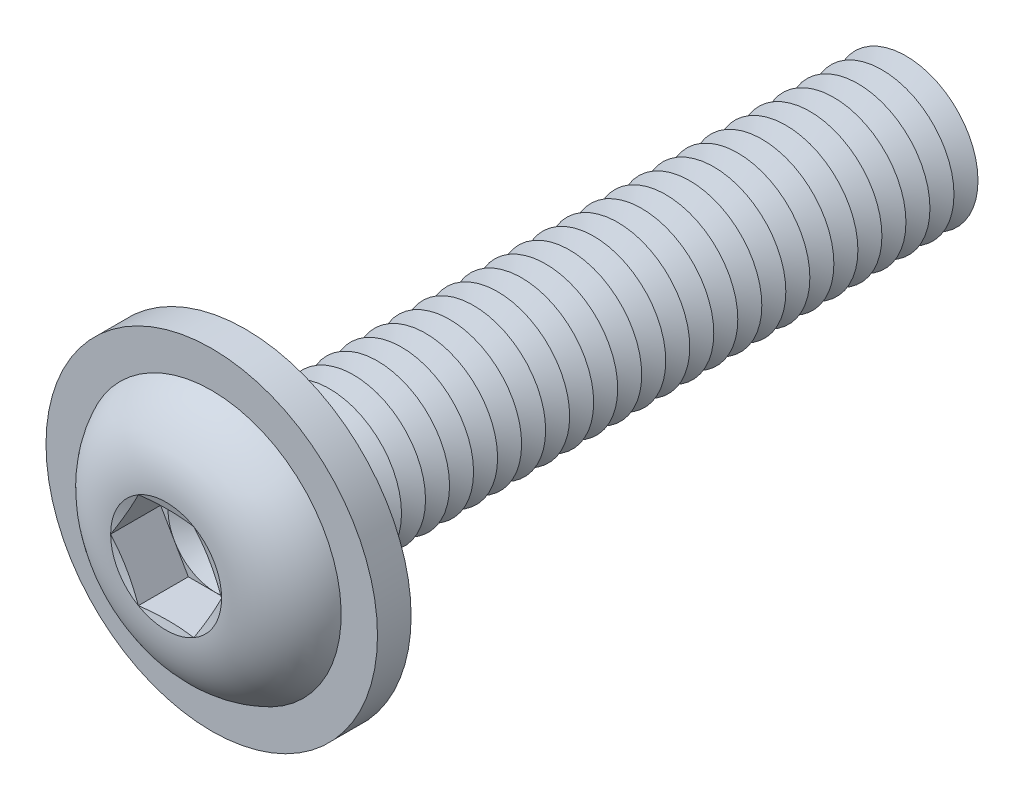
from build123d import *

# Parameters (mm, degrees)
FILLET1_R           = 0.25
LPATTERN1_COUNT     = 28
LPATTERN1_PITCH     = 0.5
CUT_EXTRUDE1_DEPTH  = 1.04
SKETCH5_R           = 3.45
SKETCH5_R_2         = 1.75
BOSS_EXTRUDE1_DEPTH = 0.7


with BuildPart() as part:
    # Sketch1 → Revolve1 (revolve)
    with BuildSketch(Plane(origin=(0, 0, 0), x_dir=(0, 0, -1), z_dir=(1, 0, 0)), mode=Mode.PRIVATE) as revolve1_sk:
        with BuildLine():
            Line((0, 1.5), (0, 2.85))
            ThreePointArc((0, 2.85), (-1.182850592, 2.35063849), (-1.65, 1.1547))
            Line((-1.65, 1.1547), (-1.495299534, 0.57735))
            Line((-1.495299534, 0.57735), (-1.65, 0.57735))
            Line((-1.65, 0.57735), (-1.65, 0))
            Line((-1.65, 0), (14, 0))
            Line((14, 0), (14, 1.5))
            Line((14, 1.5), (0, 1.5))
        make_face()
    revolve(revolve1_sk.sketch.rotate(Axis((0, 0, -14), (0, 0, 1)), 90), axis=Axis((0, 0, -14), (0, 0, 1)))

    # Fillet1
    fillet1_edges = [part.edges().sort_by_distance(p)[0] for p in [
        (1.5, 0, 0),
    ]]
    fillet(fillet1_edges, radius=FILLET1_R)

    # Sketch2 → Cut-Revolve1 (revolve, cut)
    with BuildSketch(Plane(origin=(0, 0, 0), x_dir=(0, 0, -1), z_dir=(1, 0, 0)), mode=Mode.PRIVATE) as cut_revolve1_sk:
        Polygon((13.75, 1.5), (14.25, 1.5), (14, 1.066987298), align=None)
    cut_revolve1 = revolve(cut_revolve1_sk.sketch.rotate(Axis((0, 0, -14), (0, 0, -1)), 270), axis=Axis((0, 0, -14), (0, 0, -1)), mode=Mode.SUBTRACT)

    # LPattern1: Cut-Revolve1 ×28
    with Locations(*[(0, 0, i * LPATTERN1_PITCH) for i in range(1, LPATTERN1_COUNT)]):
        add(cut_revolve1, mode=Mode.SUBTRACT)

    # Sketch3 → Cut-Extrude1 (cut)
    with BuildSketch(Plane.XY.offset(1.65)):
        Polygon((0.57735, 0.999999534), (-0.57735, 0.999999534), (-1.1547, 0), (-0.57735, -0.999999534), (0.57735, -0.999999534), (1.1547, 0), align=None)
    extrude(amount=-CUT_EXTRUDE1_DEPTH, mode=Mode.SUBTRACT)

    # Cut-Extrude2 cone 1 section (on through the dimple's axis) → Cut-Extrude2 (revolve, cut)
    with BuildSketch(Plane(origin=(0, 0, 0.61), x_dir=(0, -1, 0), z_dir=(1, 0, 0))):
        Polygon((0, 0), (0.999999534, 0), (0, 0.57735), align=None)
    revolve(axis=Axis((0, 0, 0.61), (0, 0, -1)), mode=Mode.SUBTRACT)

    # Sketch5 → Boss-Extrude1 (add)
    with BuildSketch(Plane(origin=(0, 0, 0), x_dir=(-1, 0, 0), z_dir=(0, 0, -1))):
        with Locations(Location((0, 0, 0), (0, 0, 90))):
            Circle(SKETCH5_R)
        Circle(SKETCH5_R_2, mode=Mode.SUBTRACT)
    extrude(amount=-BOSS_EXTRUDE1_DEPTH)


solid = part.part
